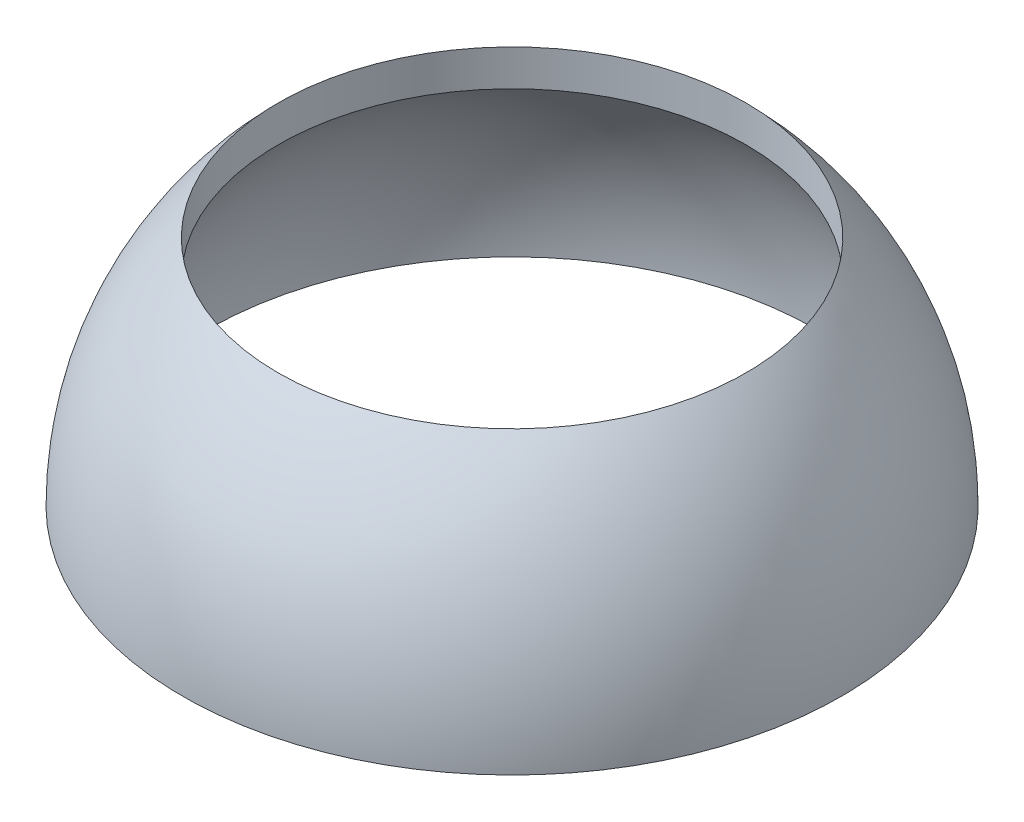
from build123d import *

# Parameters (mm, degrees)
CORTAR_EXTRUIR1_REACH      = 28.847
CORTAR_EXTRUIR1_END_RADIUS = 15.5
CROQUIS2_R                 = 11


with BuildPart() as part:
    # Croquis1 → Revoluci_n1 (revolve)
    with BuildSketch(Plane.XY):
        with BuildLine():
            Line((0, 14.35), (0, 15.5))
            ThreePointArc((0, 15.5), (10.960155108, 10.960155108), (15.5, 0))
            Line((15.5, 0), (14.35, 0))
            ThreePointArc((14.35, 0), (10.14698231, 10.14698231), (0, 14.35))
        make_face()
    revolve(axis=Axis((0, 0, 0), (0, 1, 0)))

    # Cortar-Extruir1: up to this sphere (the profile starts inside it)
    cortar_extruir1_end = Location((0, 0, 0)) * Sphere(CORTAR_EXTRUIR1_END_RADIUS, mode=Mode.PRIVATE)
    # Croquis2 → Cortar-Extruir1 (cut, up to the surface)
    with BuildSketch(Plane.XZ, mode=Mode.PRIVATE) as cortar_extruir1_sk1:
        with Locations(Location((0, 0, 0), (0, 0, 270))):
            Circle(CROQUIS2_R)
    cortar_extruir1_tool1 = extrude(cortar_extruir1_sk1.sketch, amount=-CORTAR_EXTRUIR1_REACH, mode=Mode.PRIVATE) & cortar_extruir1_end
    add(cortar_extruir1_tool1.solids().sort_by_distance((0, 0, 0))[0], mode=Mode.SUBTRACT)


solid = part.part
